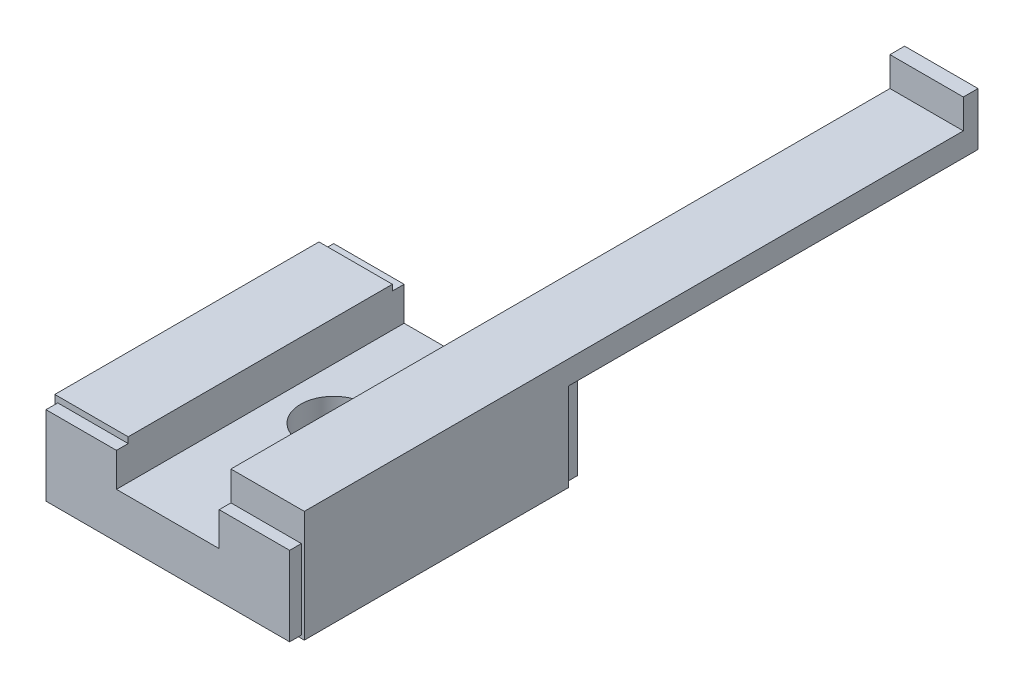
ISO-10303-21;
HEADER;
FILE_DESCRIPTION(('STEP AP214'),'2;1');
FILE_NAME('part.step','',(''),(''),'','','');
FILE_SCHEMA(('AUTOMOTIVE_DESIGN { 1 0 10303 214 1 1 1 1 }'));
ENDSEC;
DATA;
#1=APPLICATION_CONTEXT('core data for automotive mechanical design processes');
#2=APPLICATION_PROTOCOL_DEFINITION('international standard','automotive_design',2000,#1);
#3=PRODUCT_CONTEXT('',#1,'mechanical');
#4=PRODUCT('Part','Part','',(#3));
#5=PRODUCT_RELATED_PRODUCT_CATEGORY('part','',(#4));
#6=PRODUCT_DEFINITION_FORMATION('','',#4);
#7=PRODUCT_DEFINITION_CONTEXT('part definition',#1,'design');
#8=PRODUCT_DEFINITION('design','',#6,#7);
#9=PRODUCT_DEFINITION_SHAPE('','',#8);
#10=(LENGTH_UNIT() NAMED_UNIT(*) SI_UNIT(.MILLI.,.METRE.));
#11=(NAMED_UNIT(*) PLANE_ANGLE_UNIT() SI_UNIT($,.RADIAN.));
#12=(NAMED_UNIT(*) SI_UNIT($,.STERADIAN.) SOLID_ANGLE_UNIT());
#13=UNCERTAINTY_MEASURE_WITH_UNIT(LENGTH_MEASURE(1.E-05),#10,'distance_accuracy_value','');
#14=(GEOMETRIC_REPRESENTATION_CONTEXT(3) GLOBAL_UNCERTAINTY_ASSIGNED_CONTEXT((#13)) GLOBAL_UNIT_ASSIGNED_CONTEXT((#10,
#11,#12)) REPRESENTATION_CONTEXT('',''));
#15=CARTESIAN_POINT('',(0.,0.,0.));
#16=DIRECTION('',(0.,0.,1.));
#17=DIRECTION('',(1.,0.,0.));
#18=AXIS2_PLACEMENT_3D('',#15,#16,#17);
#19=CARTESIAN_POINT('',(3.5,7.6,18.8));
#20=DIRECTION('',(0.,1.,0.));
#21=DIRECTION('',(1.,0.,0.));
#22=AXIS2_PLACEMENT_3D('',#19,#20,#21);
#23=PLANE('',#22);
#24=DIRECTION('',(-1.,0.,0.));
#25=VECTOR('',#24,1.);
#26=CARTESIAN_POINT('',(8.5,7.6,-26.1));
#27=LINE('',#26,#25);
#28=CARTESIAN_POINT('',(3.5,7.6,-26.1));
#29=VERTEX_POINT('',#28);
#30=CARTESIAN_POINT('',(8.5,7.6,-26.1));
#31=VERTEX_POINT('',#30);
#32=EDGE_CURVE('E198',#29,#31,#27,.F.);
#33=ORIENTED_EDGE('',*,*,#32,.F.);
#34=DIRECTION('',(0.,0.,1.));
#35=VECTOR('',#34,1.);
#36=CARTESIAN_POINT('',(3.5,7.6,-26.1));
#37=LINE('',#36,#35);
#38=CARTESIAN_POINT('',(3.5,7.6,18.8));
#39=VERTEX_POINT('',#38);
#40=EDGE_CURVE('E213',#39,#29,#37,.F.);
#41=ORIENTED_EDGE('',*,*,#40,.F.);
#42=DIRECTION('',(1.,0.,0.));
#43=VECTOR('',#42,1.);
#44=CARTESIAN_POINT('',(3.5,7.6,18.8));
#45=LINE('',#44,#43);
#46=CARTESIAN_POINT('',(8.5,7.6,18.8));
#47=VERTEX_POINT('',#46);
#48=EDGE_CURVE('E222',#47,#39,#45,.F.);
#49=ORIENTED_EDGE('',*,*,#48,.F.);
#50=DIRECTION('',(0.,0.,-1.));
#51=VECTOR('',#50,1.);
#52=CARTESIAN_POINT('',(8.5,7.6,18.8));
#53=LINE('',#52,#51);
#54=EDGE_CURVE('E215',#47,#31,#53,.T.);
#55=ORIENTED_EDGE('',*,*,#54,.T.);
#56=EDGE_LOOP('',(#33,#41,#49,#55));
#57=FACE_BOUND('',#56,.T.);
#58=ADVANCED_FACE('F17',(#57),#23,.T.);
#59=CARTESIAN_POINT('',(-8.5,6.,18.8));
#60=DIRECTION('',(0.,1.,0.));
#61=DIRECTION('',(1.,0.,0.));
#62=AXIS2_PLACEMENT_3D('',#59,#60,#61);
#63=PLANE('',#62);
#64=DIRECTION('',(1.,0.,0.));
#65=VECTOR('',#64,1.);
#66=CARTESIAN_POINT('',(-8.5,6.,18.8));
#67=LINE('',#66,#65);
#68=CARTESIAN_POINT('',(-3.5,6.,18.8));
#69=VERTEX_POINT('',#68);
#70=CARTESIAN_POINT('',(-8.5,6.,18.8));
#71=VERTEX_POINT('',#70);
#72=EDGE_CURVE('E233',#69,#71,#67,.F.);
#73=ORIENTED_EDGE('',*,*,#72,.F.);
#74=DIRECTION('',(0.,0.,-1.));
#75=VECTOR('',#74,1.);
#76=CARTESIAN_POINT('',(-3.5,6.,18.8));
#77=LINE('',#76,#75);
#78=CARTESIAN_POINT('',(-3.5,6.,0.800000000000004));
#79=VERTEX_POINT('',#78);
#80=EDGE_CURVE('E237',#69,#79,#77,.T.);
#81=ORIENTED_EDGE('',*,*,#80,.T.);
#82=DIRECTION('',(-1.,0.,0.));
#83=VECTOR('',#82,1.);
#84=CARTESIAN_POINT('',(-3.5,6.,0.800000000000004));
#85=LINE('',#84,#83);
#86=CARTESIAN_POINT('',(-8.5,6.,0.800000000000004));
#87=VERTEX_POINT('',#86);
#88=EDGE_CURVE('E242',#79,#87,#85,.T.);
#89=ORIENTED_EDGE('',*,*,#88,.T.);
#90=DIRECTION('',(0.,0.,1.));
#91=VECTOR('',#90,1.);
#92=CARTESIAN_POINT('',(-8.5,6.,0.800000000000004));
#93=LINE('',#92,#91);
#94=EDGE_CURVE('E247',#71,#87,#93,.F.);
#95=ORIENTED_EDGE('',*,*,#94,.F.);
#96=EDGE_LOOP('',(#73,#81,#89,#95));
#97=FACE_BOUND('',#96,.T.);
#98=ADVANCED_FACE('F640',(#97),#63,.T.);
#99=CARTESIAN_POINT('',(-8.5,0.,18.8));
#100=DIRECTION('',(-1.,0.,0.));
#101=DIRECTION('',(0.,1.,0.));
#102=AXIS2_PLACEMENT_3D('',#99,#100,#101);
#103=PLANE('',#102);
#104=DIRECTION('',(0.,1.,0.));
#105=VECTOR('',#104,1.);
#106=CARTESIAN_POINT('',(-8.5,0.,18.8));
#107=LINE('',#106,#105);
#108=CARTESIAN_POINT('',(-8.5,0.,18.8));
#109=VERTEX_POINT('',#108);
#110=EDGE_CURVE('E252',#71,#109,#107,.F.);
#111=ORIENTED_EDGE('',*,*,#110,.F.);
#112=ORIENTED_EDGE('',*,*,#94,.T.);
#113=DIRECTION('',(0.,-1.,0.));
#114=VECTOR('',#113,1.);
#115=CARTESIAN_POINT('',(-8.5,6.,0.800000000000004));
#116=LINE('',#115,#114);
#117=CARTESIAN_POINT('',(-8.5,0.,0.800000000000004));
#118=VERTEX_POINT('',#117);
#119=EDGE_CURVE('E256',#87,#118,#116,.T.);
#120=ORIENTED_EDGE('',*,*,#119,.T.);
#121=DIRECTION('',(0.,0.,1.));
#122=VECTOR('',#121,1.);
#123=CARTESIAN_POINT('',(-8.5,0.,0.800000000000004));
#124=LINE('',#123,#122);
#125=EDGE_CURVE('E261',#109,#118,#124,.F.);
#126=ORIENTED_EDGE('',*,*,#125,.F.);
#127=EDGE_LOOP('',(#111,#112,#120,#126));
#128=FACE_BOUND('',#127,.T.);
#129=ADVANCED_FACE('F645',(#128),#103,.T.);
#130=CARTESIAN_POINT('',(-8.5,0.,0.8));
#131=DIRECTION('',(0.,-1.,0.));
#132=DIRECTION('',(1.,0.,0.));
#133=AXIS2_PLACEMENT_3D('',#130,#131,#132);
#134=PLANE('',#133);
#135=DIRECTION('',(-1.,0.,0.));
#136=VECTOR('',#135,1.);
#137=CARTESIAN_POINT('',(-3.5,0.,18.8));
#138=LINE('',#137,#136);
#139=CARTESIAN_POINT('',(-3.5,0.,18.8));
#140=VERTEX_POINT('',#139);
#141=EDGE_CURVE('E266',#109,#140,#138,.F.);
#142=ORIENTED_EDGE('',*,*,#141,.F.);
#143=ORIENTED_EDGE('',*,*,#125,.T.);
#144=DIRECTION('',(1.,0.,0.));
#145=VECTOR('',#144,1.);
#146=CARTESIAN_POINT('',(-8.5,0.,0.800000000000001));
#147=LINE('',#146,#145);
#148=CARTESIAN_POINT('',(-3.5,0.,0.800000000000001));
#149=VERTEX_POINT('',#148);
#150=EDGE_CURVE('E270',#118,#149,#147,.T.);
#151=ORIENTED_EDGE('',*,*,#150,.T.);
#152=DIRECTION('',(0.,0.,1.));
#153=VECTOR('',#152,1.);
#154=CARTESIAN_POINT('',(-3.5,0.,0.800000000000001));
#155=LINE('',#154,#153);
#156=EDGE_CURVE('E275',#140,#149,#155,.F.);
#157=ORIENTED_EDGE('',*,*,#156,.F.);
#158=EDGE_LOOP('',(#142,#143,#151,#157));
#159=FACE_BOUND('',#158,.T.);
#160=CARTESIAN_POINT('',(-6.,0.,5.8));
#161=DIRECTION('',(0.,1.,0.));
#162=DIRECTION('',(0.,0.,-1.));
#163=AXIS2_PLACEMENT_3D('',#160,#161,#162);
#164=CIRCLE('',#163,1.25);
#165=CARTESIAN_POINT('',(-6.,0.,4.55));
#166=VERTEX_POINT('',#165);
#167=EDGE_CURVE('E280',#166,#166,#164,.F.);
#168=ORIENTED_EDGE('',*,*,#167,.F.);
#169=EDGE_LOOP('',(#168));
#170=FACE_BOUND('',#169,.T.);
#171=CARTESIAN_POINT('',(-6.,0.,13.8));
#172=DIRECTION('',(0.,1.,0.));
#173=DIRECTION('',(0.,0.,-1.));
#174=AXIS2_PLACEMENT_3D('',#171,#172,#173);
#175=CIRCLE('',#174,1.25);
#176=CARTESIAN_POINT('',(-6.,0.,12.55));
#177=VERTEX_POINT('',#176);
#178=EDGE_CURVE('E285',#177,#177,#175,.F.);
#179=ORIENTED_EDGE('',*,*,#178,.F.);
#180=EDGE_LOOP('',(#179));
#181=FACE_BOUND('',#180,.T.);
#182=ADVANCED_FACE('F651',(#159,#170,#181),#134,.T.);
#183=CARTESIAN_POINT('',(-3.3,0.2,0.8));
#184=DIRECTION('',(0.707106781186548,-0.707106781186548,0.));
#185=DIRECTION('',(0.,0.,1.));
#186=AXIS2_PLACEMENT_3D('',#183,#184,#185);
#187=PLANE('',#186);
#188=DIRECTION('',(-0.707106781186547,-0.707106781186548,0.));
#189=VECTOR('',#188,1.);
#190=CARTESIAN_POINT('',(-3.3,0.2,18.8));
#191=LINE('',#190,#189);
#192=CARTESIAN_POINT('',(-3.3,0.2,18.8));
#193=VERTEX_POINT('',#192);
#194=EDGE_CURVE('E288',#140,#193,#191,.F.);
#195=ORIENTED_EDGE('',*,*,#194,.F.);
#196=ORIENTED_EDGE('',*,*,#156,.T.);
#197=DIRECTION('',(0.707106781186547,0.707106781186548,0.));
#198=VECTOR('',#197,1.);
#199=CARTESIAN_POINT('',(-3.5,0.,0.800000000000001));
#200=LINE('',#199,#198);
#201=CARTESIAN_POINT('',(-3.3,0.2,0.800000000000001));
#202=VERTEX_POINT('',#201);
#203=EDGE_CURVE('E290',#149,#202,#200,.T.);
#204=ORIENTED_EDGE('',*,*,#203,.T.);
#205=DIRECTION('',(0.,0.,1.));
#206=VECTOR('',#205,1.);
#207=CARTESIAN_POINT('',(-3.3,0.2,0.800000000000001));
#208=LINE('',#207,#206);
#209=EDGE_CURVE('E295',#193,#202,#208,.F.);
#210=ORIENTED_EDGE('',*,*,#209,.F.);
#211=EDGE_LOOP('',(#195,#196,#204,#210));
#212=FACE_BOUND('',#211,.T.);
#213=ADVANCED_FACE('F655',(#212),#187,.T.);
#214=CARTESIAN_POINT('',(3.5,0.,0.8));
#215=DIRECTION('',(-0.707106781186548,-0.707106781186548,0.));
#216=DIRECTION('',(0.,0.,1.));
#217=AXIS2_PLACEMENT_3D('',#214,#215,#216);
#218=PLANE('',#217);
#219=DIRECTION('',(-0.707106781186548,0.707106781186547,0.));
#220=VECTOR('',#219,1.);
#221=CARTESIAN_POINT('',(3.5,0.,18.8));
#222=LINE('',#221,#220);
#223=CARTESIAN_POINT('',(3.3,0.2,18.8));
#224=VERTEX_POINT('',#223);
#225=CARTESIAN_POINT('',(3.5,0.,18.8));
#226=VERTEX_POINT('',#225);
#227=EDGE_CURVE('E300',#224,#226,#222,.F.);
#228=ORIENTED_EDGE('',*,*,#227,.F.);
#229=DIRECTION('',(0.,0.,-1.));
#230=VECTOR('',#229,1.);
#231=CARTESIAN_POINT('',(3.3,0.2,18.8));
#232=LINE('',#231,#230);
#233=CARTESIAN_POINT('',(3.3,0.2,0.800000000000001));
#234=VERTEX_POINT('',#233);
#235=EDGE_CURVE('E304',#224,#234,#232,.T.);
#236=ORIENTED_EDGE('',*,*,#235,.T.);
#237=DIRECTION('',(0.707106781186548,-0.707106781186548,0.));
#238=VECTOR('',#237,1.);
#239=CARTESIAN_POINT('',(3.3,0.2,0.800000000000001));
#240=LINE('',#239,#238);
#241=CARTESIAN_POINT('',(3.5,0.,0.800000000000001));
#242=VERTEX_POINT('',#241);
#243=EDGE_CURVE('E309',#234,#242,#240,.T.);
#244=ORIENTED_EDGE('',*,*,#243,.T.);
#245=DIRECTION('',(0.,0.,1.));
#246=VECTOR('',#245,1.);
#247=CARTESIAN_POINT('',(3.5,0.,0.800000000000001));
#248=LINE('',#247,#246);
#249=EDGE_CURVE('E314',#226,#242,#248,.F.);
#250=ORIENTED_EDGE('',*,*,#249,.F.);
#251=EDGE_LOOP('',(#228,#236,#244,#250));
#252=FACE_BOUND('',#251,.T.);
#253=ADVANCED_FACE('F659',(#252),#218,.T.);
#254=CARTESIAN_POINT('',(3.5,0.,0.8));
#255=DIRECTION('',(0.,-1.,0.));
#256=DIRECTION('',(1.,0.,0.));
#257=AXIS2_PLACEMENT_3D('',#254,#255,#256);
#258=PLANE('',#257);
#259=DIRECTION('',(-1.,0.,0.));
#260=VECTOR('',#259,1.);
#261=CARTESIAN_POINT('',(8.5,0.,18.8));
#262=LINE('',#261,#260);
#263=CARTESIAN_POINT('',(8.5,0.,18.8));
#264=VERTEX_POINT('',#263);
#265=EDGE_CURVE('E319',#226,#264,#262,.F.);
#266=ORIENTED_EDGE('',*,*,#265,.F.);
#267=ORIENTED_EDGE('',*,*,#249,.T.);
#268=DIRECTION('',(1.,0.,0.));
#269=VECTOR('',#268,1.);
#270=CARTESIAN_POINT('',(3.5,0.,0.800000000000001));
#271=LINE('',#270,#269);
#272=CARTESIAN_POINT('',(8.5,0.,0.800000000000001));
#273=VERTEX_POINT('',#272);
#274=EDGE_CURVE('E323',#242,#273,#271,.T.);
#275=ORIENTED_EDGE('',*,*,#274,.T.);
#276=DIRECTION('',(0.,0.,1.));
#277=VECTOR('',#276,1.);
#278=CARTESIAN_POINT('',(8.5,0.,0.800000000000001));
#279=LINE('',#278,#277);
#280=EDGE_CURVE('E328',#264,#273,#279,.F.);
#281=ORIENTED_EDGE('',*,*,#280,.F.);
#282=EDGE_LOOP('',(#266,#267,#275,#281));
#283=FACE_BOUND('',#282,.T.);
#284=CARTESIAN_POINT('',(6.,0.,5.8));
#285=DIRECTION('',(0.,1.,0.));
#286=DIRECTION('',(0.,0.,-1.));
#287=AXIS2_PLACEMENT_3D('',#284,#285,#286);
#288=CIRCLE('',#287,1.25);
#289=CARTESIAN_POINT('',(6.,0.,4.55));
#290=VERTEX_POINT('',#289);
#291=EDGE_CURVE('E333',#290,#290,#288,.F.);
#292=ORIENTED_EDGE('',*,*,#291,.F.);
#293=EDGE_LOOP('',(#292));
#294=FACE_BOUND('',#293,.T.);
#295=CARTESIAN_POINT('',(6.,0.,13.8));
#296=DIRECTION('',(0.,1.,0.));
#297=DIRECTION('',(0.,0.,-1.));
#298=AXIS2_PLACEMENT_3D('',#295,#296,#297);
#299=CIRCLE('',#298,1.25);
#300=CARTESIAN_POINT('',(6.,0.,12.55));
#301=VERTEX_POINT('',#300);
#302=EDGE_CURVE('E338',#301,#301,#299,.F.);
#303=ORIENTED_EDGE('',*,*,#302,.F.);
#304=EDGE_LOOP('',(#303));
#305=FACE_BOUND('',#304,.T.);
#306=ADVANCED_FACE('F663',(#283,#294,#305),#258,.T.);
#307=CARTESIAN_POINT('',(8.5,0.,-27.1));
#308=DIRECTION('',(1.,0.,0.));
#309=DIRECTION('',(0.,1.,0.));
#310=AXIS2_PLACEMENT_3D('',#307,#308,#309);
#311=PLANE('',#310);
#312=DIRECTION('',(0.,-1.,0.));
#313=VECTOR('',#312,1.);
#314=CARTESIAN_POINT('',(8.5,7.6,18.8));
#315=LINE('',#314,#313);
#316=EDGE_CURVE('E341',#264,#47,#315,.F.);
#317=ORIENTED_EDGE('',*,*,#316,.F.);
#318=ORIENTED_EDGE('',*,*,#280,.T.);
#319=DIRECTION('',(0.,1.,0.));
#320=VECTOR('',#319,1.);
#321=CARTESIAN_POINT('',(8.5,0.,0.800000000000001));
#322=LINE('',#321,#320);
#323=CARTESIAN_POINT('',(8.5,6.,0.800000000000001));
#324=VERTEX_POINT('',#323);
#325=EDGE_CURVE('E343',#273,#324,#322,.T.);
#326=ORIENTED_EDGE('',*,*,#325,.T.);
#327=DIRECTION('',(0.,0.,-1.));
#328=VECTOR('',#327,1.);
#329=CARTESIAN_POINT('',(8.5,6.,0.800000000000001));
#330=LINE('',#329,#328);
#331=CARTESIAN_POINT('',(8.5,6.,-27.1));
#332=VERTEX_POINT('',#331);
#333=EDGE_CURVE('E348',#332,#324,#330,.F.);
#334=ORIENTED_EDGE('',*,*,#333,.F.);
#335=DIRECTION('',(0.,1.,0.));
#336=VECTOR('',#335,1.);
#337=CARTESIAN_POINT('',(8.5,6.,-27.1));
#338=LINE('',#337,#336);
#339=CARTESIAN_POINT('',(8.5,9.6,-27.1));
#340=VERTEX_POINT('',#339);
#341=EDGE_CURVE('E352',#332,#340,#338,.T.);
#342=ORIENTED_EDGE('',*,*,#341,.T.);
#343=DIRECTION('',(0.,0.,1.));
#344=VECTOR('',#343,1.);
#345=CARTESIAN_POINT('',(8.5,9.6,-27.1));
#346=LINE('',#345,#344);
#347=CARTESIAN_POINT('',(8.5,9.6,-26.1));
#348=VERTEX_POINT('',#347);
#349=EDGE_CURVE('E357',#348,#340,#346,.F.);
#350=ORIENTED_EDGE('',*,*,#349,.F.);
#351=DIRECTION('',(0.,-1.,0.));
#352=VECTOR('',#351,1.);
#353=CARTESIAN_POINT('',(8.5,9.6,-26.1));
#354=LINE('',#353,#352);
#355=EDGE_CURVE('E361',#31,#348,#354,.F.);
#356=ORIENTED_EDGE('',*,*,#355,.F.);
#357=ORIENTED_EDGE('',*,*,#54,.F.);
#358=EDGE_LOOP('',(#317,#318,#326,#334,#342,#350,#356,#357));
#359=FACE_BOUND('',#358,.T.);
#360=ADVANCED_FACE('F667',(#359),#311,.T.);
#361=CARTESIAN_POINT('',(3.5,3.3,19.6));
#362=DIRECTION('',(-1.,0.,0.));
#363=DIRECTION('',(0.,1.,0.));
#364=AXIS2_PLACEMENT_3D('',#361,#362,#363);
#365=PLANE('',#364);
#366=DIRECTION('',(0.,1.,0.));
#367=VECTOR('',#366,1.);
#368=CARTESIAN_POINT('',(3.5,3.3,19.6));
#369=LINE('',#368,#367);
#370=CARTESIAN_POINT('',(3.5,5.6,19.6));
#371=VERTEX_POINT('',#370);
#372=CARTESIAN_POINT('',(3.5,3.3,19.6));
#373=VERTEX_POINT('',#372);
#374=EDGE_CURVE('E365',#371,#373,#369,.F.);
#375=ORIENTED_EDGE('',*,*,#374,.F.);
#376=DIRECTION('',(0.,0.,-1.));
#377=VECTOR('',#376,1.);
#378=CARTESIAN_POINT('',(3.5,5.6,19.6));
#379=LINE('',#378,#377);
#380=CARTESIAN_POINT('',(3.5,5.6,18.8));
#381=VERTEX_POINT('',#380);
#382=EDGE_CURVE('E369',#381,#371,#379,.F.);
#383=ORIENTED_EDGE('',*,*,#382,.F.);
#384=DIRECTION('',(0.,1.,0.));
#385=VECTOR('',#384,1.);
#386=CARTESIAN_POINT('',(3.5,5.6,18.8));
#387=LINE('',#386,#385);
#388=EDGE_CURVE('E207',#39,#381,#387,.F.);
#389=ORIENTED_EDGE('',*,*,#388,.F.);
#390=ORIENTED_EDGE('',*,*,#40,.T.);
#391=DIRECTION('',(0.,1.,0.));
#392=VECTOR('',#391,1.);
#393=CARTESIAN_POINT('',(3.5,7.6,-26.1));
#394=LINE('',#393,#392);
#395=CARTESIAN_POINT('',(3.5,9.6,-26.1));
#396=VERTEX_POINT('',#395);
#397=EDGE_CURVE('E195',#396,#29,#394,.F.);
#398=ORIENTED_EDGE('',*,*,#397,.F.);
#399=DIRECTION('',(0.,0.,-1.));
#400=VECTOR('',#399,1.);
#401=CARTESIAN_POINT('',(3.5,9.6,-26.1));
#402=LINE('',#401,#400);
#403=CARTESIAN_POINT('',(3.5,9.6,-27.1));
#404=VERTEX_POINT('',#403);
#405=EDGE_CURVE('E206',#396,#404,#402,.T.);
#406=ORIENTED_EDGE('',*,*,#405,.T.);
#407=DIRECTION('',(0.,-1.,0.));
#408=VECTOR('',#407,1.);
#409=CARTESIAN_POINT('',(3.5,9.6,-27.1));
#410=LINE('',#409,#408);
#411=CARTESIAN_POINT('',(3.5,6.,-27.1));
#412=VERTEX_POINT('',#411);
#413=EDGE_CURVE('E381',#404,#412,#410,.T.);
#414=ORIENTED_EDGE('',*,*,#413,.T.);
#415=DIRECTION('',(0.,0.,1.));
#416=VECTOR('',#415,1.);
#417=CARTESIAN_POINT('',(3.5,6.,-27.1));
#418=LINE('',#417,#416);
#419=CARTESIAN_POINT('',(3.5,6.,0.));
#420=VERTEX_POINT('',#419);
#421=EDGE_CURVE('E386',#412,#420,#418,.T.);
#422=ORIENTED_EDGE('',*,*,#421,.T.);
#423=DIRECTION('',(0.,-1.,0.));
#424=VECTOR('',#423,1.);
#425=CARTESIAN_POINT('',(3.5,6.,0.));
#426=LINE('',#425,#424);
#427=CARTESIAN_POINT('',(3.5,3.3,0.));
#428=VERTEX_POINT('',#427);
#429=EDGE_CURVE('E391',#420,#428,#426,.T.);
#430=ORIENTED_EDGE('',*,*,#429,.T.);
#431=DIRECTION('',(0.,0.,1.));
#432=VECTOR('',#431,1.);
#433=CARTESIAN_POINT('',(3.5,3.3,0.));
#434=LINE('',#433,#432);
#435=EDGE_CURVE('E396',#373,#428,#434,.F.);
#436=ORIENTED_EDGE('',*,*,#435,.F.);
#437=EDGE_LOOP('',(#375,#383,#389,#390,#398,#406,#414,#422,#430,#436));
#438=FACE_BOUND('',#437,.T.);
#439=ADVANCED_FACE('F219',(#438),#365,.T.);
#440=CARTESIAN_POINT('',(-3.5,3.3,0.));
#441=DIRECTION('',(1.,0.,0.));
#442=DIRECTION('',(0.,1.,0.));
#443=AXIS2_PLACEMENT_3D('',#440,#441,#442);
#444=PLANE('',#443);
#445=DIRECTION('',(0.,-1.,0.));
#446=VECTOR('',#445,1.);
#447=CARTESIAN_POINT('',(-3.5,6.,18.8));
#448=LINE('',#447,#446);
#449=CARTESIAN_POINT('',(-3.5,5.6,18.8));
#450=VERTEX_POINT('',#449);
#451=EDGE_CURVE('E400',#450,#69,#448,.F.);
#452=ORIENTED_EDGE('',*,*,#451,.F.);
#453=DIRECTION('',(0.,0.,1.));
#454=VECTOR('',#453,1.);
#455=CARTESIAN_POINT('',(-3.5,5.6,18.8));
#456=LINE('',#455,#454);
#457=CARTESIAN_POINT('',(-3.5,5.6,19.6));
#458=VERTEX_POINT('',#457);
#459=EDGE_CURVE('E404',#450,#458,#456,.T.);
#460=ORIENTED_EDGE('',*,*,#459,.T.);
#461=DIRECTION('',(0.,-1.,0.));
#462=VECTOR('',#461,1.);
#463=CARTESIAN_POINT('',(-3.5,5.6,19.6));
#464=LINE('',#463,#462);
#465=CARTESIAN_POINT('',(-3.5,3.3,19.6));
#466=VERTEX_POINT('',#465);
#467=EDGE_CURVE('E409',#466,#458,#464,.F.);
#468=ORIENTED_EDGE('',*,*,#467,.F.);
#469=DIRECTION('',(0.,0.,-1.));
#470=VECTOR('',#469,1.);
#471=CARTESIAN_POINT('',(-3.5,3.3,19.6));
#472=LINE('',#471,#470);
#473=CARTESIAN_POINT('',(-3.5,3.3,0.));
#474=VERTEX_POINT('',#473);
#475=EDGE_CURVE('E414',#466,#474,#472,.T.);
#476=ORIENTED_EDGE('',*,*,#475,.T.);
#477=DIRECTION('',(0.,1.,0.));
#478=VECTOR('',#477,1.);
#479=CARTESIAN_POINT('',(-3.5,3.3,0.));
#480=LINE('',#479,#478);
#481=CARTESIAN_POINT('',(-3.5,5.6,0.));
#482=VERTEX_POINT('',#481);
#483=EDGE_CURVE('E419',#474,#482,#480,.T.);
#484=ORIENTED_EDGE('',*,*,#483,.T.);
#485=DIRECTION('',(0.,0.,1.));
#486=VECTOR('',#485,1.);
#487=CARTESIAN_POINT('',(-3.5,5.6,0.));
#488=LINE('',#487,#486);
#489=CARTESIAN_POINT('',(-3.5,5.6,0.800000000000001));
#490=VERTEX_POINT('',#489);
#491=EDGE_CURVE('E424',#490,#482,#488,.F.);
#492=ORIENTED_EDGE('',*,*,#491,.F.);
#493=DIRECTION('',(0.,1.,0.));
#494=VECTOR('',#493,1.);
#495=CARTESIAN_POINT('',(-3.5,5.6,0.800000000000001));
#496=LINE('',#495,#494);
#497=EDGE_CURVE('E428',#490,#79,#496,.T.);
#498=ORIENTED_EDGE('',*,*,#497,.T.);
#499=ORIENTED_EDGE('',*,*,#80,.F.);
#500=EDGE_LOOP('',(#452,#460,#468,#476,#484,#492,#498,#499));
#501=FACE_BOUND('',#500,.T.);
#502=ADVANCED_FACE('F674',(#501),#444,.T.);
#503=CARTESIAN_POINT('',(-8.3,0.2,0.));
#504=DIRECTION('',(0.,0.,-1.));
#505=DIRECTION('',(0.,1.,0.));
#506=AXIS2_PLACEMENT_3D('',#503,#504,#505);
#507=PLANE('',#506);
#508=DIRECTION('',(1.,0.,0.));
#509=VECTOR('',#508,1.);
#510=CARTESIAN_POINT('',(3.5,6.,0.));
#511=LINE('',#510,#509);
#512=CARTESIAN_POINT('',(8.3,6.,0.));
#513=VERTEX_POINT('',#512);
#514=EDGE_CURVE('E433',#420,#513,#511,.T.);
#515=ORIENTED_EDGE('',*,*,#514,.T.);
#516=DIRECTION('',(0.,-1.,0.));
#517=VECTOR('',#516,1.);
#518=CARTESIAN_POINT('',(8.3,6.,0.));
#519=LINE('',#518,#517);
#520=CARTESIAN_POINT('',(8.3,0.200000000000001,0.));
#521=VERTEX_POINT('',#520);
#522=EDGE_CURVE('E438',#513,#521,#519,.T.);
#523=ORIENTED_EDGE('',*,*,#522,.T.);
#524=DIRECTION('',(-1.,0.,0.));
#525=VECTOR('',#524,1.);
#526=CARTESIAN_POINT('',(8.3,0.2,0.));
#527=LINE('',#526,#525);
#528=CARTESIAN_POINT('',(-8.3,0.2,0.));
#529=VERTEX_POINT('',#528);
#530=EDGE_CURVE('E443',#529,#521,#527,.F.);
#531=ORIENTED_EDGE('',*,*,#530,.F.);
#532=DIRECTION('',(0.,1.,0.));
#533=VECTOR('',#532,1.);
#534=CARTESIAN_POINT('',(-8.3,0.2,0.));
#535=LINE('',#534,#533);
#536=CARTESIAN_POINT('',(-8.3,5.6,0.));
#537=VERTEX_POINT('',#536);
#538=EDGE_CURVE('E448',#529,#537,#535,.T.);
#539=ORIENTED_EDGE('',*,*,#538,.T.);
#540=DIRECTION('',(1.,0.,0.));
#541=VECTOR('',#540,1.);
#542=CARTESIAN_POINT('',(-8.3,5.6,0.));
#543=LINE('',#542,#541);
#544=EDGE_CURVE('E453',#537,#482,#543,.T.);
#545=ORIENTED_EDGE('',*,*,#544,.T.);
#546=ORIENTED_EDGE('',*,*,#483,.F.);
#547=DIRECTION('',(1.,0.,0.));
#548=VECTOR('',#547,1.);
#549=CARTESIAN_POINT('',(-3.5,3.3,0.));
#550=LINE('',#549,#548);
#551=EDGE_CURVE('E458',#428,#474,#550,.F.);
#552=ORIENTED_EDGE('',*,*,#551,.F.);
#553=ORIENTED_EDGE('',*,*,#429,.F.);
#554=EDGE_LOOP('',(#515,#523,#531,#539,#545,#546,#552,#553));
#555=FACE_BOUND('',#554,.T.);
#556=ADVANCED_FACE('F677',(#555),#507,.T.);
#557=CARTESIAN_POINT('',(-8.3,0.2,0.));
#558=DIRECTION('',(0.,-1.,0.));
#559=DIRECTION('',(1.,0.,0.));
#560=AXIS2_PLACEMENT_3D('',#557,#558,#559);
#561=PLANE('',#560);
#562=DIRECTION('',(-1.,0.,0.));
#563=VECTOR('',#562,1.);
#564=CARTESIAN_POINT('',(8.3,0.2,19.6));
#565=LINE('',#564,#563);
#566=CARTESIAN_POINT('',(-8.3,0.2,19.6));
#567=VERTEX_POINT('',#566);
#568=CARTESIAN_POINT('',(8.3,0.2,19.6));
#569=VERTEX_POINT('',#568);
#570=EDGE_CURVE('E462',#567,#569,#565,.F.);
#571=ORIENTED_EDGE('',*,*,#570,.F.);
#572=DIRECTION('',(0.,0.,-1.));
#573=VECTOR('',#572,1.);
#574=CARTESIAN_POINT('',(-8.3,0.2,19.6));
#575=LINE('',#574,#573);
#576=CARTESIAN_POINT('',(-8.3,0.2,18.8));
#577=VERTEX_POINT('',#576);
#578=EDGE_CURVE('E467',#577,#567,#575,.F.);
#579=ORIENTED_EDGE('',*,*,#578,.F.);
#580=DIRECTION('',(1.,0.,0.));
#581=VECTOR('',#580,1.);
#582=CARTESIAN_POINT('',(-8.3,0.2,18.8));
#583=LINE('',#582,#581);
#584=EDGE_CURVE('E471',#193,#577,#583,.F.);
#585=ORIENTED_EDGE('',*,*,#584,.F.);
#586=ORIENTED_EDGE('',*,*,#209,.T.);
#587=DIRECTION('',(-1.,0.,0.));
#588=VECTOR('',#587,1.);
#589=CARTESIAN_POINT('',(-3.3,0.2,0.800000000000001));
#590=LINE('',#589,#588);
#591=CARTESIAN_POINT('',(-8.3,0.2,0.800000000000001));
#592=VERTEX_POINT('',#591);
#593=EDGE_CURVE('E475',#202,#592,#590,.T.);
#594=ORIENTED_EDGE('',*,*,#593,.T.);
#595=DIRECTION('',(0.,0.,-1.));
#596=VECTOR('',#595,1.);
#597=CARTESIAN_POINT('',(-8.3,0.2,0.800000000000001));
#598=LINE('',#597,#596);
#599=EDGE_CURVE('E480',#592,#529,#598,.T.);
#600=ORIENTED_EDGE('',*,*,#599,.T.);
#601=ORIENTED_EDGE('',*,*,#530,.T.);
#602=DIRECTION('',(0.,0.,1.));
#603=VECTOR('',#602,1.);
#604=CARTESIAN_POINT('',(8.3,0.2,0.));
#605=LINE('',#604,#603);
#606=CARTESIAN_POINT('',(8.3,0.2,0.800000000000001));
#607=VERTEX_POINT('',#606);
#608=EDGE_CURVE('E485',#607,#521,#605,.F.);
#609=ORIENTED_EDGE('',*,*,#608,.F.);
#610=DIRECTION('',(-1.,0.,0.));
#611=VECTOR('',#610,1.);
#612=CARTESIAN_POINT('',(8.3,0.2,0.800000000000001));
#613=LINE('',#612,#611);
#614=EDGE_CURVE('E489',#607,#234,#613,.T.);
#615=ORIENTED_EDGE('',*,*,#614,.T.);
#616=ORIENTED_EDGE('',*,*,#235,.F.);
#617=DIRECTION('',(1.,0.,0.));
#618=VECTOR('',#617,1.);
#619=CARTESIAN_POINT('',(3.3,0.2,18.8));
#620=LINE('',#619,#618);
#621=CARTESIAN_POINT('',(8.3,0.2,18.8));
#622=VERTEX_POINT('',#621);
#623=EDGE_CURVE('E494',#622,#224,#620,.F.);
#624=ORIENTED_EDGE('',*,*,#623,.F.);
#625=DIRECTION('',(0.,0.,1.));
#626=VECTOR('',#625,1.);
#627=CARTESIAN_POINT('',(8.3,0.2,18.8));
#628=LINE('',#627,#626);
#629=EDGE_CURVE('E498',#622,#569,#628,.T.);
#630=ORIENTED_EDGE('',*,*,#629,.T.);
#631=EDGE_LOOP('',(#571,#579,#585,#586,#594,#600,#601,#609,#615,#616,#624,#630));
#632=FACE_BOUND('',#631,.T.);
#633=CARTESIAN_POINT('',(0.,0.2,8.3));
#634=DIRECTION('',(0.,1.,0.));
#635=DIRECTION('',(-1.42053863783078E-07,0.,-0.99999999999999));
#636=AXIS2_PLACEMENT_3D('',#633,#634,#635);
#637=CIRCLE('',#636,2.25);
#638=CARTESIAN_POINT('',(-3.19621193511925E-07,0.2,6.05000000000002));
#639=VERTEX_POINT('',#638);
#640=EDGE_CURVE('E503',#639,#639,#637,.F.);
#641=ORIENTED_EDGE('',*,*,#640,.F.);
#642=EDGE_LOOP('',(#641));
#643=FACE_BOUND('',#642,.T.);
#644=CARTESIAN_POINT('',(0.,0.2,13.8));
#645=DIRECTION('',(0.,1.,0.));
#646=DIRECTION('',(0.,0.,-1.));
#647=AXIS2_PLACEMENT_3D('',#644,#645,#646);
#648=CIRCLE('',#647,1.);
#649=CARTESIAN_POINT('',(0.,0.2,12.8));
#650=VERTEX_POINT('',#649);
#651=EDGE_CURVE('E508',#650,#650,#648,.F.);
#652=ORIENTED_EDGE('',*,*,#651,.F.);
#653=EDGE_LOOP('',(#652));
#654=FACE_BOUND('',#653,.T.);
#655=ADVANCED_FACE('F681',(#632,#643,#654),#561,.T.);
#656=CARTESIAN_POINT('',(-3.5,3.3,19.6));
#657=DIRECTION('',(0.,1.,0.));
#658=DIRECTION('',(1.,0.,0.));
#659=AXIS2_PLACEMENT_3D('',#656,#657,#658);
#660=PLANE('',#659);
#661=ORIENTED_EDGE('',*,*,#551,.T.);
#662=ORIENTED_EDGE('',*,*,#475,.F.);
#663=DIRECTION('',(1.,0.,0.));
#664=VECTOR('',#663,1.);
#665=CARTESIAN_POINT('',(-3.5,3.3,19.6));
#666=LINE('',#665,#664);
#667=EDGE_CURVE('E511',#373,#466,#666,.F.);
#668=ORIENTED_EDGE('',*,*,#667,.F.);
#669=ORIENTED_EDGE('',*,*,#435,.T.);
#670=EDGE_LOOP('',(#661,#662,#668,#669));
#671=FACE_BOUND('',#670,.T.);
#672=CARTESIAN_POINT('',(0.,3.3,8.3));
#673=DIRECTION('',(0.,-1.,0.));
#674=DIRECTION('',(-1.42053904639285E-07,0.,0.99999999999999));
#675=AXIS2_PLACEMENT_3D('',#672,#673,#674);
#676=CIRCLE('',#675,2.25);
#677=CARTESIAN_POINT('',(-3.19621285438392E-07,3.3,10.55));
#678=VERTEX_POINT('',#677);
#679=EDGE_CURVE('E513',#678,#678,#676,.F.);
#680=ORIENTED_EDGE('',*,*,#679,.F.);
#681=EDGE_LOOP('',(#680));
#682=FACE_BOUND('',#681,.T.);
#683=ADVANCED_FACE('F685',(#671,#682),#660,.T.);
#684=CARTESIAN_POINT('',(-8.3,0.2,19.6));
#685=DIRECTION('',(0.,0.,1.));
#686=DIRECTION('',(1.,0.,0.));
#687=AXIS2_PLACEMENT_3D('',#684,#685,#686);
#688=PLANE('',#687);
#689=DIRECTION('',(-1.,0.,0.));
#690=VECTOR('',#689,1.);
#691=CARTESIAN_POINT('',(8.3,5.6,19.6));
#692=LINE('',#691,#690);
#693=CARTESIAN_POINT('',(8.3,5.6,19.6));
#694=VERTEX_POINT('',#693);
#695=EDGE_CURVE('E518',#371,#694,#692,.F.);
#696=ORIENTED_EDGE('',*,*,#695,.F.);
#697=ORIENTED_EDGE('',*,*,#374,.T.);
#698=ORIENTED_EDGE('',*,*,#667,.T.);
#699=ORIENTED_EDGE('',*,*,#467,.T.);
#700=DIRECTION('',(-1.,0.,0.));
#701=VECTOR('',#700,1.);
#702=CARTESIAN_POINT('',(-3.5,5.6,19.6));
#703=LINE('',#702,#701);
#704=CARTESIAN_POINT('',(-8.3,5.6,19.6));
#705=VERTEX_POINT('',#704);
#706=EDGE_CURVE('E521',#705,#458,#703,.F.);
#707=ORIENTED_EDGE('',*,*,#706,.F.);
#708=DIRECTION('',(0.,-1.,0.));
#709=VECTOR('',#708,1.);
#710=CARTESIAN_POINT('',(-8.3,5.6,19.6));
#711=LINE('',#710,#709);
#712=EDGE_CURVE('E525',#567,#705,#711,.F.);
#713=ORIENTED_EDGE('',*,*,#712,.F.);
#714=ORIENTED_EDGE('',*,*,#570,.T.);
#715=DIRECTION('',(0.,1.,0.));
#716=VECTOR('',#715,1.);
#717=CARTESIAN_POINT('',(8.3,0.2,19.6));
#718=LINE('',#717,#716);
#719=EDGE_CURVE('E529',#694,#569,#718,.F.);
#720=ORIENTED_EDGE('',*,*,#719,.F.);
#721=EDGE_LOOP('',(#696,#697,#698,#699,#707,#713,#714,#720));
#722=FACE_BOUND('',#721,.T.);
#723=ADVANCED_FACE('F689',(#722),#688,.T.);
#724=CARTESIAN_POINT('',(-8.3,5.6,0.));
#725=DIRECTION('',(0.,1.,0.));
#726=DIRECTION('',(0.,0.,1.));
#727=AXIS2_PLACEMENT_3D('',#724,#725,#726);
#728=PLANE('',#727);
#729=ORIENTED_EDGE('',*,*,#544,.F.);
#730=DIRECTION('',(0.,0.,1.));
#731=VECTOR('',#730,1.);
#732=CARTESIAN_POINT('',(-8.3,5.6,0.));
#733=LINE('',#732,#731);
#734=CARTESIAN_POINT('',(-8.3,5.6,0.8));
#735=VERTEX_POINT('',#734);
#736=EDGE_CURVE('E533',#735,#537,#733,.F.);
#737=ORIENTED_EDGE('',*,*,#736,.F.);
#738=DIRECTION('',(1.,0.,0.));
#739=VECTOR('',#738,1.);
#740=CARTESIAN_POINT('',(-8.3,5.6,0.8));
#741=LINE('',#740,#739);
#742=EDGE_CURVE('E537',#735,#490,#741,.T.);
#743=ORIENTED_EDGE('',*,*,#742,.T.);
#744=ORIENTED_EDGE('',*,*,#491,.T.);
#745=EDGE_LOOP('',(#729,#737,#743,#744));
#746=FACE_BOUND('',#745,.T.);
#747=ADVANCED_FACE('F693',(#746),#728,.T.);
#748=CARTESIAN_POINT('',(-8.3,0.2,0.));
#749=DIRECTION('',(-1.,0.,0.));
#750=DIRECTION('',(0.,0.,1.));
#751=AXIS2_PLACEMENT_3D('',#748,#749,#750);
#752=PLANE('',#751);
#753=ORIENTED_EDGE('',*,*,#538,.F.);
#754=ORIENTED_EDGE('',*,*,#599,.F.);
#755=DIRECTION('',(0.,1.,0.));
#756=VECTOR('',#755,1.);
#757=CARTESIAN_POINT('',(-8.3,0.2,0.8));
#758=LINE('',#757,#756);
#759=EDGE_CURVE('E542',#592,#735,#758,.T.);
#760=ORIENTED_EDGE('',*,*,#759,.T.);
#761=ORIENTED_EDGE('',*,*,#736,.T.);
#762=EDGE_LOOP('',(#753,#754,#760,#761));
#763=FACE_BOUND('',#762,.T.);
#764=ADVANCED_FACE('F697',(#763),#752,.T.);
#765=CARTESIAN_POINT('',(-8.5,0.,0.8));
#766=DIRECTION('',(0.,0.,-1.));
#767=DIRECTION('',(0.,1.,0.));
#768=AXIS2_PLACEMENT_3D('',#765,#766,#767);
#769=PLANE('',#768);
#770=ORIENTED_EDGE('',*,*,#150,.F.);
#771=ORIENTED_EDGE('',*,*,#119,.F.);
#772=ORIENTED_EDGE('',*,*,#88,.F.);
#773=ORIENTED_EDGE('',*,*,#497,.F.);
#774=ORIENTED_EDGE('',*,*,#742,.F.);
#775=ORIENTED_EDGE('',*,*,#759,.F.);
#776=ORIENTED_EDGE('',*,*,#593,.F.);
#777=ORIENTED_EDGE('',*,*,#203,.F.);
#778=EDGE_LOOP('',(#770,#771,#772,#773,#774,#775,#776,#777));
#779=FACE_BOUND('',#778,.T.);
#780=ADVANCED_FACE('F701',(#779),#769,.T.);
#781=CARTESIAN_POINT('',(3.3,0.,0.8));
#782=DIRECTION('',(0.,0.,-1.));
#783=DIRECTION('',(0.,1.,0.));
#784=AXIS2_PLACEMENT_3D('',#781,#782,#783);
#785=PLANE('',#784);
#786=DIRECTION('',(0.,1.,0.));
#787=VECTOR('',#786,1.);
#788=CARTESIAN_POINT('',(8.3,0.2,0.8));
#789=LINE('',#788,#787);
#790=CARTESIAN_POINT('',(8.3,6.,0.8));
#791=VERTEX_POINT('',#790);
#792=EDGE_CURVE('E547',#791,#607,#789,.F.);
#793=ORIENTED_EDGE('',*,*,#792,.F.);
#794=DIRECTION('',(1.,0.,0.));
#795=VECTOR('',#794,1.);
#796=CARTESIAN_POINT('',(8.3,6.,0.8));
#797=LINE('',#796,#795);
#798=EDGE_CURVE('E551',#791,#324,#797,.T.);
#799=ORIENTED_EDGE('',*,*,#798,.T.);
#800=ORIENTED_EDGE('',*,*,#325,.F.);
#801=ORIENTED_EDGE('',*,*,#274,.F.);
#802=ORIENTED_EDGE('',*,*,#243,.F.);
#803=ORIENTED_EDGE('',*,*,#614,.F.);
#804=EDGE_LOOP('',(#793,#799,#800,#801,#802,#803));
#805=FACE_BOUND('',#804,.T.);
#806=ADVANCED_FACE('F705',(#805),#785,.T.);
#807=CARTESIAN_POINT('',(8.3,0.2,0.8));
#808=DIRECTION('',(1.,0.,0.));
#809=DIRECTION('',(0.,0.,-1.));
#810=AXIS2_PLACEMENT_3D('',#807,#808,#809);
#811=PLANE('',#810);
#812=ORIENTED_EDGE('',*,*,#522,.F.);
#813=DIRECTION('',(0.,0.,1.));
#814=VECTOR('',#813,1.);
#815=CARTESIAN_POINT('',(8.3,6.,0.));
#816=LINE('',#815,#814);
#817=EDGE_CURVE('E556',#791,#513,#816,.F.);
#818=ORIENTED_EDGE('',*,*,#817,.F.);
#819=ORIENTED_EDGE('',*,*,#792,.T.);
#820=ORIENTED_EDGE('',*,*,#608,.T.);
#821=EDGE_LOOP('',(#812,#818,#819,#820));
#822=FACE_BOUND('',#821,.T.);
#823=ADVANCED_FACE('F709',(#822),#811,.T.);
#824=CARTESIAN_POINT('',(-8.3,5.6,19.6));
#825=DIRECTION('',(0.,1.,0.));
#826=DIRECTION('',(1.,0.,0.));
#827=AXIS2_PLACEMENT_3D('',#824,#825,#826);
#828=PLANE('',#827);
#829=ORIENTED_EDGE('',*,*,#706,.T.);
#830=ORIENTED_EDGE('',*,*,#459,.F.);
#831=DIRECTION('',(-1.,0.,0.));
#832=VECTOR('',#831,1.);
#833=CARTESIAN_POINT('',(-3.5,5.6,18.8));
#834=LINE('',#833,#832);
#835=CARTESIAN_POINT('',(-8.3,5.6,18.8));
#836=VERTEX_POINT('',#835);
#837=EDGE_CURVE('E560',#836,#450,#834,.F.);
#838=ORIENTED_EDGE('',*,*,#837,.F.);
#839=DIRECTION('',(0.,0.,1.));
#840=VECTOR('',#839,1.);
#841=CARTESIAN_POINT('',(-8.3,5.6,18.8));
#842=LINE('',#841,#840);
#843=EDGE_CURVE('E564',#836,#705,#842,.T.);
#844=ORIENTED_EDGE('',*,*,#843,.T.);
#845=EDGE_LOOP('',(#829,#830,#838,#844));
#846=FACE_BOUND('',#845,.T.);
#847=ADVANCED_FACE('F713',(#846),#828,.T.);
#848=CARTESIAN_POINT('',(-8.3,0.2,19.6));
#849=DIRECTION('',(-1.,0.,0.));
#850=DIRECTION('',(0.,1.,0.));
#851=AXIS2_PLACEMENT_3D('',#848,#849,#850);
#852=PLANE('',#851);
#853=ORIENTED_EDGE('',*,*,#712,.T.);
#854=ORIENTED_EDGE('',*,*,#843,.F.);
#855=DIRECTION('',(0.,-1.,0.));
#856=VECTOR('',#855,1.);
#857=CARTESIAN_POINT('',(-8.3,5.6,18.8));
#858=LINE('',#857,#856);
#859=EDGE_CURVE('E40',#577,#836,#858,.F.);
#860=ORIENTED_EDGE('',*,*,#859,.F.);
#861=ORIENTED_EDGE('',*,*,#578,.T.);
#862=EDGE_LOOP('',(#853,#854,#860,#861));
#863=FACE_BOUND('',#862,.T.);
#864=ADVANCED_FACE('F717',(#863),#852,.T.);
#865=CARTESIAN_POINT('',(-8.5,0.,18.8));
#866=DIRECTION('',(0.,0.,1.));
#867=DIRECTION('',(1.,0.,0.));
#868=AXIS2_PLACEMENT_3D('',#865,#866,#867);
#869=PLANE('',#868);
#870=ORIENTED_EDGE('',*,*,#194,.T.);
#871=ORIENTED_EDGE('',*,*,#584,.T.);
#872=ORIENTED_EDGE('',*,*,#859,.T.);
#873=ORIENTED_EDGE('',*,*,#837,.T.);
#874=ORIENTED_EDGE('',*,*,#451,.T.);
#875=ORIENTED_EDGE('',*,*,#72,.T.);
#876=ORIENTED_EDGE('',*,*,#110,.T.);
#877=ORIENTED_EDGE('',*,*,#141,.T.);
#878=EDGE_LOOP('',(#870,#871,#872,#873,#874,#875,#876,#877));
#879=FACE_BOUND('',#878,.T.);
#880=ADVANCED_FACE('F721',(#879),#869,.T.);
#881=CARTESIAN_POINT('',(3.3,0.,18.8));
#882=DIRECTION('',(0.,0.,1.));
#883=DIRECTION('',(1.,0.,0.));
#884=AXIS2_PLACEMENT_3D('',#881,#882,#883);
#885=PLANE('',#884);
#886=ORIENTED_EDGE('',*,*,#227,.T.);
#887=ORIENTED_EDGE('',*,*,#265,.T.);
#888=ORIENTED_EDGE('',*,*,#316,.T.);
#889=ORIENTED_EDGE('',*,*,#48,.T.);
#890=ORIENTED_EDGE('',*,*,#388,.T.);
#891=DIRECTION('',(1.,0.,0.));
#892=VECTOR('',#891,1.);
#893=CARTESIAN_POINT('',(3.5,5.6,18.8));
#894=LINE('',#893,#892);
#895=CARTESIAN_POINT('',(8.3,5.6,18.8));
#896=VERTEX_POINT('',#895);
#897=EDGE_CURVE('E572',#381,#896,#894,.T.);
#898=ORIENTED_EDGE('',*,*,#897,.T.);
#899=DIRECTION('',(0.,-1.,0.));
#900=VECTOR('',#899,1.);
#901=CARTESIAN_POINT('',(8.3,5.6,18.8));
#902=LINE('',#901,#900);
#903=EDGE_CURVE('E32',#896,#622,#902,.T.);
#904=ORIENTED_EDGE('',*,*,#903,.T.);
#905=ORIENTED_EDGE('',*,*,#623,.T.);
#906=EDGE_LOOP('',(#886,#887,#888,#889,#890,#898,#904,#905));
#907=FACE_BOUND('',#906,.T.);
#908=ADVANCED_FACE('F725',(#907),#885,.T.);
#909=CARTESIAN_POINT('',(3.5,5.6,19.6));
#910=DIRECTION('',(0.,1.,0.));
#911=DIRECTION('',(1.,0.,0.));
#912=AXIS2_PLACEMENT_3D('',#909,#910,#911);
#913=PLANE('',#912);
#914=ORIENTED_EDGE('',*,*,#695,.T.);
#915=DIRECTION('',(0.,0.,-1.));
#916=VECTOR('',#915,1.);
#917=CARTESIAN_POINT('',(8.3,5.6,19.6));
#918=LINE('',#917,#916);
#919=EDGE_CURVE('E580',#896,#694,#918,.F.);
#920=ORIENTED_EDGE('',*,*,#919,.F.);
#921=ORIENTED_EDGE('',*,*,#897,.F.);
#922=ORIENTED_EDGE('',*,*,#382,.T.);
#923=EDGE_LOOP('',(#914,#920,#921,#922));
#924=FACE_BOUND('',#923,.T.);
#925=ADVANCED_FACE('F728',(#924),#913,.T.);
#926=CARTESIAN_POINT('',(8.3,0.2,18.8));
#927=DIRECTION('',(1.,0.,0.));
#928=DIRECTION('',(0.,1.,0.));
#929=AXIS2_PLACEMENT_3D('',#926,#927,#928);
#930=PLANE('',#929);
#931=ORIENTED_EDGE('',*,*,#719,.T.);
#932=ORIENTED_EDGE('',*,*,#629,.F.);
#933=ORIENTED_EDGE('',*,*,#903,.F.);
#934=ORIENTED_EDGE('',*,*,#919,.T.);
#935=EDGE_LOOP('',(#931,#932,#933,#934));
#936=FACE_BOUND('',#935,.T.);
#937=ADVANCED_FACE('F732',(#936),#930,.T.);
#938=CARTESIAN_POINT('',(3.5,6.,0.800000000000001));
#939=DIRECTION('',(0.,-1.,0.));
#940=DIRECTION('',(0.,0.,-1.));
#941=AXIS2_PLACEMENT_3D('',#938,#939,#940);
#942=PLANE('',#941);
#943=ORIENTED_EDGE('',*,*,#514,.F.);
#944=ORIENTED_EDGE('',*,*,#421,.F.);
#945=DIRECTION('',(1.,0.,0.));
#946=VECTOR('',#945,1.);
#947=CARTESIAN_POINT('',(3.5,6.,-27.1));
#948=LINE('',#947,#946);
#949=EDGE_CURVE('E584',#412,#332,#948,.T.);
#950=ORIENTED_EDGE('',*,*,#949,.T.);
#951=ORIENTED_EDGE('',*,*,#333,.T.);
#952=ORIENTED_EDGE('',*,*,#798,.F.);
#953=ORIENTED_EDGE('',*,*,#817,.T.);
#954=EDGE_LOOP('',(#943,#944,#950,#951,#952,#953));
#955=FACE_BOUND('',#954,.T.);
#956=ADVANCED_FACE('F736',(#955),#942,.T.);
#957=CARTESIAN_POINT('',(3.5,6.,-27.1));
#958=DIRECTION('',(0.,0.,-1.));
#959=DIRECTION('',(0.,1.,0.));
#960=AXIS2_PLACEMENT_3D('',#957,#958,#959);
#961=PLANE('',#960);
#962=ORIENTED_EDGE('',*,*,#413,.F.);
#963=DIRECTION('',(1.,0.,0.));
#964=VECTOR('',#963,1.);
#965=CARTESIAN_POINT('',(3.5,9.6,-27.1));
#966=LINE('',#965,#964);
#967=EDGE_CURVE('E589',#340,#404,#966,.F.);
#968=ORIENTED_EDGE('',*,*,#967,.F.);
#969=ORIENTED_EDGE('',*,*,#341,.F.);
#970=ORIENTED_EDGE('',*,*,#949,.F.);
#971=EDGE_LOOP('',(#962,#968,#969,#970));
#972=FACE_BOUND('',#971,.T.);
#973=ADVANCED_FACE('F739',(#972),#961,.T.);
#974=CARTESIAN_POINT('',(4.98039928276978,3.,6.8065));
#975=DIRECTION('',(0.,-1.,0.));
#976=DIRECTION('',(0.,0.,-1.));
#977=AXIS2_PLACEMENT_3D('',#974,#975,#976);
#978=PLANE('',#977);
#979=CARTESIAN_POINT('',(6.,3.,5.8));
#980=DIRECTION('',(0.,-1.,0.));
#981=DIRECTION('',(0.,0.,1.));
#982=AXIS2_PLACEMENT_3D('',#979,#980,#981);
#983=CIRCLE('',#982,1.0065);
#984=CARTESIAN_POINT('',(6.,3.,6.8065));
#985=VERTEX_POINT('',#984);
#986=EDGE_CURVE('E593',#985,#985,#983,.T.);
#987=ORIENTED_EDGE('',*,*,#986,.T.);
#988=EDGE_LOOP('',(#987));
#989=FACE_BOUND('',#988,.T.);
#990=ADVANCED_FACE('F743',(#989),#978,.T.);
#991=CARTESIAN_POINT('',(-7.01960071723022,3.,6.8065));
#992=DIRECTION('',(0.,-1.,0.));
#993=DIRECTION('',(0.,0.,-1.));
#994=AXIS2_PLACEMENT_3D('',#991,#992,#993);
#995=PLANE('',#994);
#996=CARTESIAN_POINT('',(-6.,3.,5.8));
#997=DIRECTION('',(0.,-1.,0.));
#998=DIRECTION('',(0.,0.,1.));
#999=AXIS2_PLACEMENT_3D('',#996,#997,#998);
#1000=CIRCLE('',#999,1.0065);
#1001=CARTESIAN_POINT('',(-6.,3.,6.8065));
#1002=VERTEX_POINT('',#1001);
#1003=EDGE_CURVE('E598',#1002,#1002,#1000,.T.);
#1004=ORIENTED_EDGE('',*,*,#1003,.T.);
#1005=EDGE_LOOP('',(#1004));
#1006=FACE_BOUND('',#1005,.T.);
#1007=ADVANCED_FACE('F747',(#1006),#995,.T.);
#1008=CARTESIAN_POINT('',(4.98039928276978,3.,14.8065));
#1009=DIRECTION('',(0.,-1.,0.));
#1010=DIRECTION('',(0.,0.,-1.));
#1011=AXIS2_PLACEMENT_3D('',#1008,#1009,#1010);
#1012=PLANE('',#1011);
#1013=CARTESIAN_POINT('',(6.,3.,13.8));
#1014=DIRECTION('',(0.,-1.,0.));
#1015=DIRECTION('',(0.,0.,1.));
#1016=AXIS2_PLACEMENT_3D('',#1013,#1014,#1015);
#1017=CIRCLE('',#1016,1.0065);
#1018=CARTESIAN_POINT('',(6.,3.,14.8065));
#1019=VERTEX_POINT('',#1018);
#1020=EDGE_CURVE('E601',#1019,#1019,#1017,.T.);
#1021=ORIENTED_EDGE('',*,*,#1020,.T.);
#1022=EDGE_LOOP('',(#1021));
#1023=FACE_BOUND('',#1022,.T.);
#1024=ADVANCED_FACE('F751',(#1023),#1012,.T.);
#1025=CARTESIAN_POINT('',(-7.01960071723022,3.,14.8065));
#1026=DIRECTION('',(0.,-1.,0.));
#1027=DIRECTION('',(0.,0.,-1.));
#1028=AXIS2_PLACEMENT_3D('',#1025,#1026,#1027);
#1029=PLANE('',#1028);
#1030=CARTESIAN_POINT('',(-6.,3.,13.8));
#1031=DIRECTION('',(0.,-1.,0.));
#1032=DIRECTION('',(0.,0.,1.));
#1033=AXIS2_PLACEMENT_3D('',#1030,#1031,#1032);
#1034=CIRCLE('',#1033,1.0065);
#1035=CARTESIAN_POINT('',(-6.,3.,14.8065));
#1036=VERTEX_POINT('',#1035);
#1037=EDGE_CURVE('E604',#1036,#1036,#1034,.T.);
#1038=ORIENTED_EDGE('',*,*,#1037,.T.);
#1039=EDGE_LOOP('',(#1038));
#1040=FACE_BOUND('',#1039,.T.);
#1041=ADVANCED_FACE('F755',(#1040),#1029,.T.);
#1042=CARTESIAN_POINT('',(-1.01301611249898,2.2,12.8));
#1043=DIRECTION('',(0.,-1.,0.));
#1044=DIRECTION('',(1.,0.,0.));
#1045=AXIS2_PLACEMENT_3D('',#1042,#1043,#1044);
#1046=PLANE('',#1045);
#1047=CARTESIAN_POINT('',(0.,2.2,13.8));
#1048=DIRECTION('',(0.,-1.,0.));
#1049=DIRECTION('',(0.,0.,1.));
#1050=AXIS2_PLACEMENT_3D('',#1047,#1048,#1049);
#1051=CIRCLE('',#1050,1.);
#1052=CARTESIAN_POINT('',(0.,2.2,14.8));
#1053=VERTEX_POINT('',#1052);
#1054=EDGE_CURVE('E607',#1053,#1053,#1051,.F.);
#1055=ORIENTED_EDGE('',*,*,#1054,.F.);
#1056=EDGE_LOOP('',(#1055));
#1057=FACE_BOUND('',#1056,.T.);
#1058=ADVANCED_FACE('F759',(#1057),#1046,.T.);
#1059=CARTESIAN_POINT('',(3.5,9.6,-26.1));
#1060=DIRECTION('',(0.,1.,0.));
#1061=DIRECTION('',(1.,0.,0.));
#1062=AXIS2_PLACEMENT_3D('',#1059,#1060,#1061);
#1063=PLANE('',#1062);
#1064=ORIENTED_EDGE('',*,*,#967,.T.);
#1065=ORIENTED_EDGE('',*,*,#405,.F.);
#1066=DIRECTION('',(1.,0.,0.));
#1067=VECTOR('',#1066,1.);
#1068=CARTESIAN_POINT('',(3.5,9.6,-26.1));
#1069=LINE('',#1068,#1067);
#1070=EDGE_CURVE('E201',#348,#396,#1069,.F.);
#1071=ORIENTED_EDGE('',*,*,#1070,.F.);
#1072=ORIENTED_EDGE('',*,*,#349,.T.);
#1073=EDGE_LOOP('',(#1064,#1065,#1071,#1072));
#1074=FACE_BOUND('',#1073,.T.);
#1075=ADVANCED_FACE('F763',(#1074),#1063,.T.);
#1076=CARTESIAN_POINT('',(3.5,7.6,-26.1));
#1077=DIRECTION('',(0.,0.,1.));
#1078=DIRECTION('',(1.,0.,0.));
#1079=AXIS2_PLACEMENT_3D('',#1076,#1077,#1078);
#1080=PLANE('',#1079);
#1081=ORIENTED_EDGE('',*,*,#1070,.T.);
#1082=ORIENTED_EDGE('',*,*,#397,.T.);
#1083=ORIENTED_EDGE('',*,*,#32,.T.);
#1084=ORIENTED_EDGE('',*,*,#355,.T.);
#1085=EDGE_LOOP('',(#1081,#1082,#1083,#1084));
#1086=FACE_BOUND('',#1085,.T.);
#1087=ADVANCED_FACE('F197',(#1086),#1080,.T.);
#1088=CARTESIAN_POINT('',(6.,0.,5.8));
#1089=DIRECTION('',(0.,-1.,0.));
#1090=DIRECTION('',(0.,0.,1.));
#1091=AXIS2_PLACEMENT_3D('',#1088,#1089,#1090);
#1092=CYLINDRICAL_SURFACE('',#1091,1.0065);
#1093=CARTESIAN_POINT('',(6.,0.2435,5.8));
#1094=DIRECTION('',(0.,-1.,0.));
#1095=DIRECTION('',(0.,0.,1.));
#1096=AXIS2_PLACEMENT_3D('',#1093,#1094,#1095);
#1097=CIRCLE('',#1096,1.0065);
#1098=CARTESIAN_POINT('',(6.,0.2435,6.8065));
#1099=VERTEX_POINT('',#1098);
#1100=EDGE_CURVE('E611',#1099,#1099,#1097,.T.);
#1101=ORIENTED_EDGE('',*,*,#1100,.T.);
#1102=EDGE_LOOP('',(#1101));
#1103=FACE_BOUND('',#1102,.T.);
#1104=ORIENTED_EDGE('',*,*,#986,.F.);
#1105=EDGE_LOOP('',(#1104));
#1106=FACE_BOUND('',#1105,.T.);
#1107=ADVANCED_FACE('F770',(#1103,#1106),#1092,.F.);
#1108=CARTESIAN_POINT('',(6.,0.,5.8));
#1109=DIRECTION('',(0.,-1.,0.));
#1110=DIRECTION('',(1.42053938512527E-07,0.,0.99999999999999));
#1111=AXIS2_PLACEMENT_3D('',#1108,#1109,#1110);
#1112=CONICAL_SURFACE('',#1111,1.25,0.78539816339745);
#1113=ORIENTED_EDGE('',*,*,#291,.T.);
#1114=EDGE_LOOP('',(#1113));
#1115=FACE_BOUND('',#1114,.T.);
#1116=ORIENTED_EDGE('',*,*,#1100,.F.);
#1117=EDGE_LOOP('',(#1116));
#1118=FACE_BOUND('',#1117,.T.);
#1119=ADVANCED_FACE('F773',(#1115,#1118),#1112,.F.);
#1120=CARTESIAN_POINT('',(-6.,0.,5.8));
#1121=DIRECTION('',(0.,-1.,0.));
#1122=DIRECTION('',(0.,0.,1.));
#1123=AXIS2_PLACEMENT_3D('',#1120,#1121,#1122);
#1124=CYLINDRICAL_SURFACE('',#1123,1.0065);
#1125=CARTESIAN_POINT('',(-6.,0.2435,5.8));
#1126=DIRECTION('',(0.,-1.,0.));
#1127=DIRECTION('',(0.,0.,1.));
#1128=AXIS2_PLACEMENT_3D('',#1125,#1126,#1127);
#1129=CIRCLE('',#1128,1.0065);
#1130=CARTESIAN_POINT('',(-6.,0.2435,6.8065));
#1131=VERTEX_POINT('',#1130);
#1132=EDGE_CURVE('E616',#1131,#1131,#1129,.T.);
#1133=ORIENTED_EDGE('',*,*,#1132,.T.);
#1134=EDGE_LOOP('',(#1133));
#1135=FACE_BOUND('',#1134,.T.);
#1136=ORIENTED_EDGE('',*,*,#1003,.F.);
#1137=EDGE_LOOP('',(#1136));
#1138=FACE_BOUND('',#1137,.T.);
#1139=ADVANCED_FACE('F777',(#1135,#1138),#1124,.F.);
#1140=CARTESIAN_POINT('',(-6.,0.,5.8));
#1141=DIRECTION('',(0.,-1.,0.));
#1142=DIRECTION('',(1.42053938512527E-07,0.,0.99999999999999));
#1143=AXIS2_PLACEMENT_3D('',#1140,#1141,#1142);
#1144=CONICAL_SURFACE('',#1143,1.25,0.78539816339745);
#1145=ORIENTED_EDGE('',*,*,#167,.T.);
#1146=EDGE_LOOP('',(#1145));
#1147=FACE_BOUND('',#1146,.T.);
#1148=ORIENTED_EDGE('',*,*,#1132,.F.);
#1149=EDGE_LOOP('',(#1148));
#1150=FACE_BOUND('',#1149,.T.);
#1151=ADVANCED_FACE('F637',(#1147,#1150),#1144,.F.);
#1152=CARTESIAN_POINT('',(6.,0.,13.8));
#1153=DIRECTION('',(0.,-1.,0.));
#1154=DIRECTION('',(0.,0.,1.));
#1155=AXIS2_PLACEMENT_3D('',#1152,#1153,#1154);
#1156=CYLINDRICAL_SURFACE('',#1155,1.0065);
#1157=CARTESIAN_POINT('',(6.,0.2435,13.8));
#1158=DIRECTION('',(0.,-1.,0.));
#1159=DIRECTION('',(0.,0.,1.));
#1160=AXIS2_PLACEMENT_3D('',#1157,#1158,#1159);
#1161=CIRCLE('',#1160,1.0065);
#1162=CARTESIAN_POINT('',(6.,0.2435,14.8065));
#1163=VERTEX_POINT('',#1162);
#1164=EDGE_CURVE('E25',#1163,#1163,#1161,.T.);
#1165=ORIENTED_EDGE('',*,*,#1164,.T.);
#1166=EDGE_LOOP('',(#1165));
#1167=FACE_BOUND('',#1166,.T.);
#1168=ORIENTED_EDGE('',*,*,#1020,.F.);
#1169=EDGE_LOOP('',(#1168));
#1170=FACE_BOUND('',#1169,.T.);
#1171=ADVANCED_FACE('F621',(#1167,#1170),#1156,.F.);
#1172=CARTESIAN_POINT('',(6.,0.,13.8));
#1173=DIRECTION('',(0.,-1.,0.));
#1174=DIRECTION('',(0.,0.,1.));
#1175=AXIS2_PLACEMENT_3D('',#1172,#1173,#1174);
#1176=CONICAL_SURFACE('',#1175,1.25,0.785398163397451);
#1177=ORIENTED_EDGE('',*,*,#302,.T.);
#1178=EDGE_LOOP('',(#1177));
#1179=FACE_BOUND('',#1178,.T.);
#1180=ORIENTED_EDGE('',*,*,#1164,.F.);
#1181=EDGE_LOOP('',(#1180));
#1182=FACE_BOUND('',#1181,.T.);
#1183=ADVANCED_FACE('F624',(#1179,#1182),#1176,.F.);
#1184=CARTESIAN_POINT('',(-6.,0.,13.8));
#1185=DIRECTION('',(0.,-1.,0.));
#1186=DIRECTION('',(0.,0.,1.));
#1187=AXIS2_PLACEMENT_3D('',#1184,#1185,#1186);
#1188=CYLINDRICAL_SURFACE('',#1187,1.0065);
#1189=CARTESIAN_POINT('',(-6.,0.2435,13.8));
#1190=DIRECTION('',(0.,-1.,0.));
#1191=DIRECTION('',(0.,0.,1.));
#1192=AXIS2_PLACEMENT_3D('',#1189,#1190,#1191);
#1193=CIRCLE('',#1192,1.0065);
#1194=CARTESIAN_POINT('',(-6.,0.2435,14.8065));
#1195=VERTEX_POINT('',#1194);
#1196=EDGE_CURVE('E11',#1195,#1195,#1193,.T.);
#1197=ORIENTED_EDGE('',*,*,#1196,.T.);
#1198=EDGE_LOOP('',(#1197));
#1199=FACE_BOUND('',#1198,.T.);
#1200=ORIENTED_EDGE('',*,*,#1037,.F.);
#1201=EDGE_LOOP('',(#1200));
#1202=FACE_BOUND('',#1201,.T.);
#1203=ADVANCED_FACE('F626',(#1199,#1202),#1188,.F.);
#1204=CARTESIAN_POINT('',(-6.,0.,13.8));
#1205=DIRECTION('',(0.,-1.,0.));
#1206=DIRECTION('',(0.,0.,1.));
#1207=AXIS2_PLACEMENT_3D('',#1204,#1205,#1206);
#1208=CONICAL_SURFACE('',#1207,1.25,0.785398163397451);
#1209=ORIENTED_EDGE('',*,*,#178,.T.);
#1210=EDGE_LOOP('',(#1209));
#1211=FACE_BOUND('',#1210,.T.);
#1212=ORIENTED_EDGE('',*,*,#1196,.F.);
#1213=EDGE_LOOP('',(#1212));
#1214=FACE_BOUND('',#1213,.T.);
#1215=ADVANCED_FACE('F634',(#1211,#1214),#1208,.F.);
#1216=CARTESIAN_POINT('',(0.,2.2,13.8));
#1217=DIRECTION('',(0.,-1.,0.));
#1218=DIRECTION('',(0.,0.,1.));
#1219=AXIS2_PLACEMENT_3D('',#1216,#1217,#1218);
#1220=CYLINDRICAL_SURFACE('',#1219,1.);
#1221=ORIENTED_EDGE('',*,*,#1054,.T.);
#1222=EDGE_LOOP('',(#1221));
#1223=FACE_BOUND('',#1222,.T.);
#1224=ORIENTED_EDGE('',*,*,#651,.T.);
#1225=EDGE_LOOP('',(#1224));
#1226=FACE_BOUND('',#1225,.T.);
#1227=ADVANCED_FACE('F797',(#1223,#1226),#1220,.F.);
#1228=CARTESIAN_POINT('',(0.,3.4,8.3));
#1229=DIRECTION('',(0.,-1.,0.));
#1230=DIRECTION('',(0.,0.,1.));
#1231=AXIS2_PLACEMENT_3D('',#1228,#1229,#1230);
#1232=CYLINDRICAL_SURFACE('',#1231,2.25);
#1233=ORIENTED_EDGE('',*,*,#679,.T.);
#1234=EDGE_LOOP('',(#1233));
#1235=FACE_BOUND('',#1234,.T.);
#1236=ORIENTED_EDGE('',*,*,#640,.T.);
#1237=EDGE_LOOP('',(#1236));
#1238=FACE_BOUND('',#1237,.T.);
#1239=ADVANCED_FACE('F19',(#1235,#1238),#1232,.F.);
#1240=CLOSED_SHELL('',(#58,#98,#129,#182,#213,#253,#306,#360,#439,#502,#556,#655,#683,#723,#747,
#764,#780,#806,#823,#847,#864,#880,#908,#925,#937,#956,#973,#990,#1007,#1024,#1041,#1058,#1075,
#1087,#1107,#1119,#1139,#1151,#1171,#1183,#1203,#1215,#1227,#1239));
#1241=MANIFOLD_SOLID_BREP('B1',#1240);
#1242=ADVANCED_BREP_SHAPE_REPRESENTATION('',(#18,#1241),#14);
#1243=SHAPE_DEFINITION_REPRESENTATION(#9,#1242);
ENDSEC;
END-ISO-10303-21;
